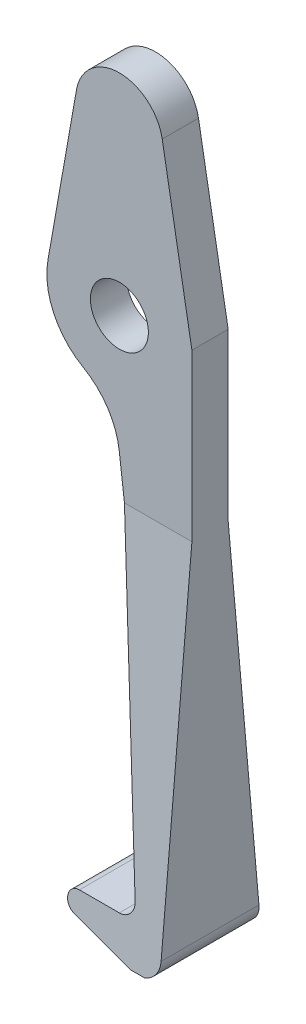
from build123d import *

# Parameters (mm, degrees)
EXTRUDE1_DEPTH                 = 7
CUT_EXTRUDE1_DEPTH             = 75.01351228
CUT_EXTRUDE1_DEPTH_BACK        = 75.01351228
SKETCH2_OUTSIDE_W              = 36.976
SKETCH2_OUTSIDE_H              = 124.976
M8_0_8_000000_DIAMETER_HOLE1_D = 8


with BuildPart() as part:
    # Sketch1 → Extrude1 (new, symmetric)
    with BuildSketch(Plane.XY):
        with BuildLine():
            Line((-9.847610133, 1.739130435), (-5.90856608, 24.043478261))
            ThreePointArc((-5.90856608, 24.043478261), (0, 29), (5.90856608, 24.043478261))
            Line((5.90856608, 24.043478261), (10, 0.876241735))
            Line((10, 0.876241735), (10, -70))
            ThreePointArc((10, -70), (8.763355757, -72.427050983), (6.072949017, -72.853169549))
            Line((6.072949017, -72.853169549), (-1.963525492, -70.241960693))
            ThreePointArc((-1.963525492, -70.241960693), (-2.981532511, -68.580724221), (-1.5, -67.315375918))
            Line((-1.5, -67.315375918), (4, -67.315375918))
            ThreePointArc((4, -67.315375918), (5.497911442, -66.640616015), (5.985092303, -65.071637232))
            Line((5.985092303, -65.071637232), (-0.024080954, -16.13084848))
            ThreePointArc((-0.024080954, -16.13084848), (-1.618725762, -11.818041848), (-4.974771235, -8.674770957))
            ThreePointArc((-4.974771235, -8.674770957), (-9.057487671, -4.238150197), (-9.847610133, 1.739130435))
        make_face()
    extrude(amount=EXTRUDE1_DEPTH, both=True)

    # Sketch2 outside → Cut-Extrude1 (cut, two sides: drawn at the far end of the back side and taken through both)
    with BuildSketch(Plane(origin=(0, 0, 0), x_dir=(0, 0, -1), z_dir=(1, 0, 0)).offset(-CUT_EXTRUDE1_DEPTH_BACK)):
        with Locations((0, -22)):
            Rectangle(SKETCH2_OUTSIDE_W, SKETCH2_OUTSIDE_H)
        Polygon((2.5, 29), (-2.5, 29), (-2.5, -22), (-7, -72.853169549), (7, -72.853169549), (2.5, -22), align=None, mode=Mode.SUBTRACT)
    extrude(amount=CUT_EXTRUDE1_DEPTH + CUT_EXTRUDE1_DEPTH_BACK, mode=Mode.SUBTRACT)

    # M8.0 _8.000000_ Diameter Hole1 (through all)
    with Locations(Plane.XY.offset(2.5)):
        with Locations((0, 0)):
            Hole(M8_0_8_000000_DIAMETER_HOLE1_D / 2)


solid = part.part
